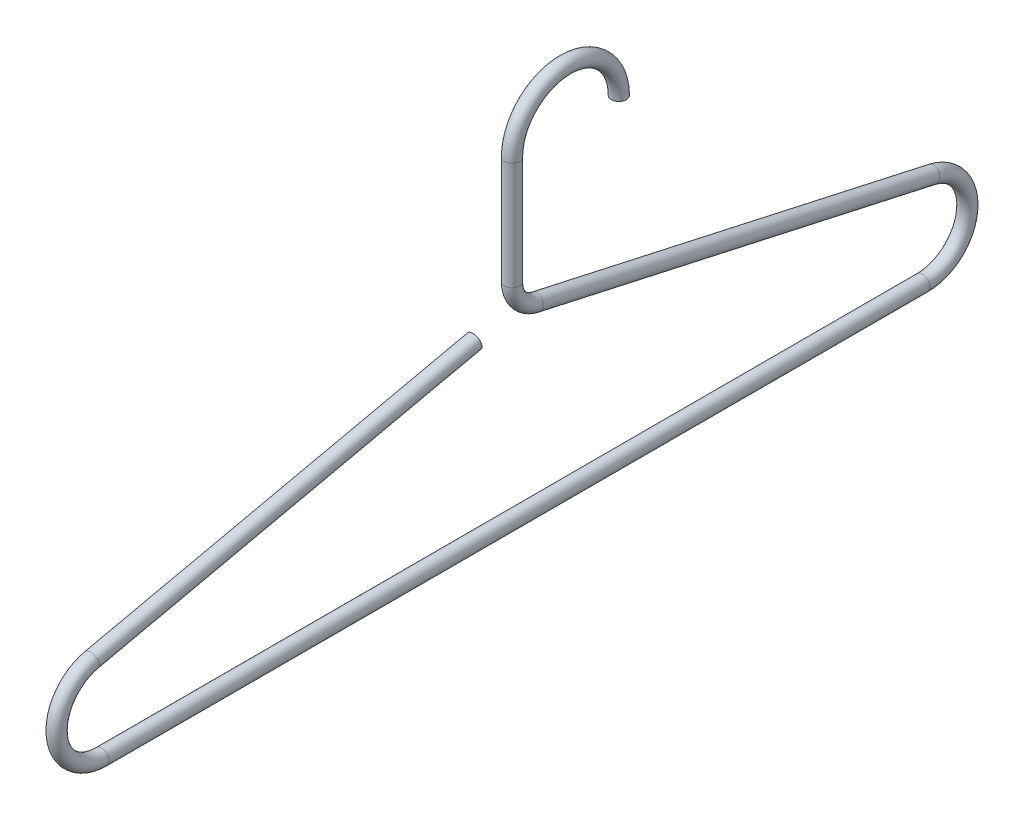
from build123d import *

# Parameters (mm, degrees)
SKETCH2_R = 3.175


with BuildPart() as part:
    # Sweep1: sweep along a path in Sketch1
    with BuildLine(Plane(origin=(0, 0, 0), x_dir=(0, 0, -1), z_dir=(1, 0, 0))) as sweep1_path:
        Line((-15.877829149, -4.311433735), (-177.807440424, -40.12850914))
        ThreePointArc((-177.807440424, -40.12850914), (-192.63050064, -60.79828413), (-173.693228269, -77.778932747))
        Line((-173.693228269, -77.778932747), (173.693228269, -77.778932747))
        ThreePointArc((173.693228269, -77.778932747), (192.63050064, -60.79828413), (177.807440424, -40.12850914))
        Line((177.807440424, -40.12850914), (9.957191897, -3.001852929))
        ThreePointArc((9.957191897, -3.001852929), (2.797382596, 1.446815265), (0, 9.398429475))
        Line((0, 9.398429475), (0, 55.109156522))
        ThreePointArc((0, 55.109156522), (22.608503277, 77.717659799), (45.217006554, 55.109156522))
    # Sketch2 → Sweep1 (sweep)
    with BuildSketch(Plane(origin=(0, -4.311433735, 15.877829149), x_dir=(-0.9108718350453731, -0.4029499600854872, -0.0891281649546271), z_dir=(0, 0.2159691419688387, -0.9764001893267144))):
        Circle(SKETCH2_R)
    sweep(path=sweep1_path.line)


solid = part.part
